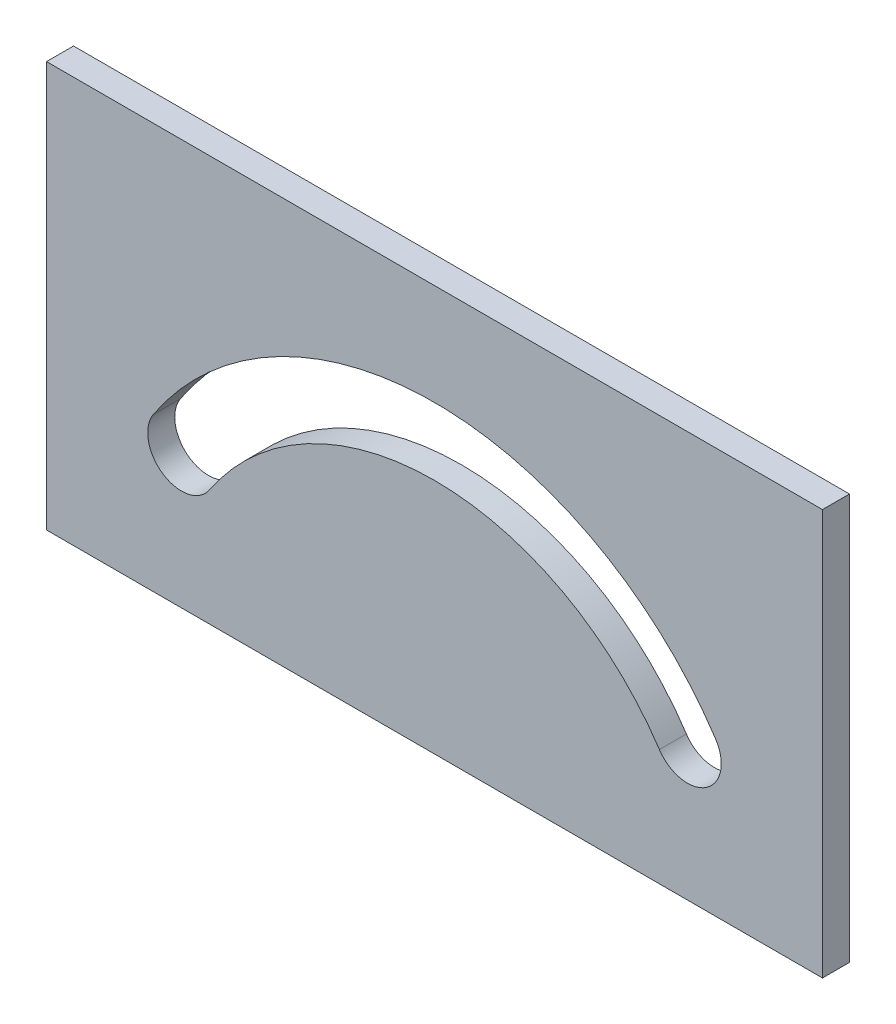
from build123d import *

# Parameters (mm, degrees)
SKETCH1_W      = 115
SKETCH1_H      = 60.125314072
EXTRUDE1_DEPTH = 4


with BuildPart() as part:
    # Sketch1 → Extrude1 (new body)
    with BuildSketch(Plane.XY):
        with Locations((37.5, 10.062657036)):
            Rectangle(SKETCH1_W, SKETCH1_H)
        with BuildLine():
            ThreePointArc((4.166666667, -2.763853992), (37.5, 15.125314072), (70.833333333, -2.763853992))
            ThreePointArc((70.833333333, -2.763853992), (77.763853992, -4.166666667), (79.166666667, 2.763853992))
            ThreePointArc((79.166666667, 2.763853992), (37.5, 25.125314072), (-4.166666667, 2.763853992))
            ThreePointArc((-4.166666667, 2.763853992), (-2.763853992, -4.166666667), (4.166666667, -2.763853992))
        make_face(mode=Mode.SUBTRACT)
    extrude(amount=EXTRUDE1_DEPTH)


solid = part.part
